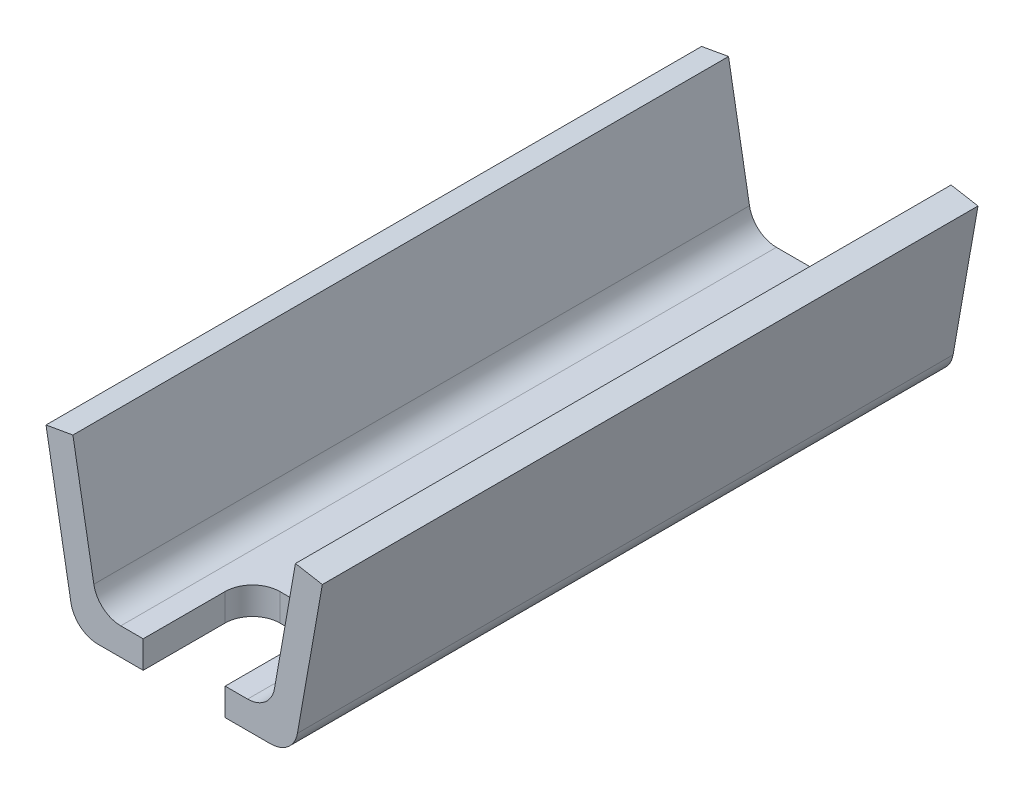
ISO-10303-21;
HEADER;
FILE_DESCRIPTION(('STEP AP214'),'2;1');
FILE_NAME('part.step','',(''),(''),'','','');
FILE_SCHEMA(('AUTOMOTIVE_DESIGN { 1 0 10303 214 1 1 1 1 }'));
ENDSEC;
DATA;
#1=APPLICATION_CONTEXT('core data for automotive mechanical design processes');
#2=APPLICATION_PROTOCOL_DEFINITION('international standard','automotive_design',2000,#1);
#3=PRODUCT_CONTEXT('',#1,'mechanical');
#4=PRODUCT('Part','Part','',(#3));
#5=PRODUCT_RELATED_PRODUCT_CATEGORY('part','',(#4));
#6=PRODUCT_DEFINITION_FORMATION('','',#4);
#7=PRODUCT_DEFINITION_CONTEXT('part definition',#1,'design');
#8=PRODUCT_DEFINITION('design','',#6,#7);
#9=PRODUCT_DEFINITION_SHAPE('','',#8);
#10=(LENGTH_UNIT() NAMED_UNIT(*) SI_UNIT(.MILLI.,.METRE.));
#11=(NAMED_UNIT(*) PLANE_ANGLE_UNIT() SI_UNIT($,.RADIAN.));
#12=(NAMED_UNIT(*) SI_UNIT($,.STERADIAN.) SOLID_ANGLE_UNIT());
#13=UNCERTAINTY_MEASURE_WITH_UNIT(LENGTH_MEASURE(1.E-05),#10,'distance_accuracy_value','');
#14=(GEOMETRIC_REPRESENTATION_CONTEXT(3) GLOBAL_UNCERTAINTY_ASSIGNED_CONTEXT((#13)) GLOBAL_UNIT_ASSIGNED_CONTEXT((#10,
#11,#12)) REPRESENTATION_CONTEXT('',''));
#15=CARTESIAN_POINT('',(0.,0.,0.));
#16=DIRECTION('',(0.,0.,1.));
#17=DIRECTION('',(1.,0.,0.));
#18=AXIS2_PLACEMENT_3D('',#15,#16,#17);
#19=CARTESIAN_POINT('',(11.6090036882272,10.,120.));
#20=DIRECTION('',(0.,0.,1.));
#21=DIRECTION('',(1.,0.,0.));
#22=AXIS2_PLACEMENT_3D('',#19,#20,#21);
#23=PLANE('',#22);
#24=DIRECTION('',(0.,-1.,0.));
#25=VECTOR('',#24,1.);
#26=CARTESIAN_POINT('',(-7.5,10.,120.));
#27=LINE('',#26,#25);
#28=CARTESIAN_POINT('',(-7.5,5.,120.));
#29=VERTEX_POINT('',#28);
#30=CARTESIAN_POINT('',(-7.5,0.,120.));
#31=VERTEX_POINT('',#30);
#32=EDGE_CURVE('E11',#29,#31,#27,.T.);
#33=ORIENTED_EDGE('',*,*,#32,.F.);
#34=DIRECTION('',(-1.,0.,0.));
#35=VECTOR('',#34,1.);
#36=CARTESIAN_POINT('',(11.6090036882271,5.,120.));
#37=LINE('',#36,#35);
#38=CARTESIAN_POINT('',(-11.6090036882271,5.,120.));
#39=VERTEX_POINT('',#38);
#40=EDGE_CURVE('E246',#29,#39,#37,.T.);
#41=ORIENTED_EDGE('',*,*,#40,.T.);
#42=CARTESIAN_POINT('',(-11.6090036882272,9.99999999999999,120.));
#43=DIRECTION('',(0.,0.,-1.));
#44=DIRECTION('',(-1.,0.,0.));
#45=AXIS2_PLACEMENT_3D('',#42,#43,#44);
#46=CIRCLE('',#45,5.);
#47=CARTESIAN_POINT('',(-16.5330424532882,9.13175911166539,120.));
#48=VERTEX_POINT('',#47);
#49=EDGE_CURVE('E250',#39,#48,#46,.T.);
#50=ORIENTED_EDGE('',*,*,#49,.T.);
#51=DIRECTION('',(-0.173648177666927,0.984807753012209,0.));
#52=VECTOR('',#51,1.);
#53=CARTESIAN_POINT('',(-16.5330424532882,9.13175911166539,120.));
#54=LINE('',#53,#52);
#55=CARTESIAN_POINT('',(-20.3657706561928,30.8682408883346,120.));
#56=VERTEX_POINT('',#55);
#57=EDGE_CURVE('E252',#48,#56,#54,.T.);
#58=ORIENTED_EDGE('',*,*,#57,.T.);
#59=DIRECTION('',(-0.984807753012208,-0.173648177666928,0.));
#60=VECTOR('',#59,1.);
#61=CARTESIAN_POINT('',(-25.2898094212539,30.,120.));
#62=LINE('',#61,#60);
#63=CARTESIAN_POINT('',(-25.2898094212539,30.,120.));
#64=VERTEX_POINT('',#63);
#65=EDGE_CURVE('E254',#56,#64,#62,.T.);
#66=ORIENTED_EDGE('',*,*,#65,.T.);
#67=DIRECTION('',(0.173648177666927,-0.984807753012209,0.));
#68=VECTOR('',#67,1.);
#69=CARTESIAN_POINT('',(-20.7285406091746,4.13175911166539,120.));
#70=LINE('',#69,#68);
#71=CARTESIAN_POINT('',(-20.7285406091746,4.13175911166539,120.));
#72=VERTEX_POINT('',#71);
#73=EDGE_CURVE('E256',#64,#72,#70,.T.);
#74=ORIENTED_EDGE('',*,*,#73,.T.);
#75=CARTESIAN_POINT('',(-15.8045018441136,5.,120.));
#76=DIRECTION('',(0.,0.,1.));
#77=DIRECTION('',(-1.,0.,0.));
#78=AXIS2_PLACEMENT_3D('',#75,#76,#77);
#79=CIRCLE('',#78,5.);
#80=CARTESIAN_POINT('',(-15.8045018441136,0.,120.));
#81=VERTEX_POINT('',#80);
#82=EDGE_CURVE('E258',#72,#81,#79,.T.);
#83=ORIENTED_EDGE('',*,*,#82,.T.);
#84=DIRECTION('',(1.,0.,0.));
#85=VECTOR('',#84,1.);
#86=CARTESIAN_POINT('',(-15.8045018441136,0.,120.));
#87=LINE('',#86,#85);
#88=EDGE_CURVE('E261',#81,#31,#87,.T.);
#89=ORIENTED_EDGE('',*,*,#88,.T.);
#90=EDGE_LOOP('',(#33,#41,#50,#58,#66,#74,#83,#89));
#91=FACE_BOUND('',#90,.T.);
#92=ADVANCED_FACE('F41',(#91),#23,.T.);
#93=CARTESIAN_POINT('',(25.2898094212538,30.,120.));
#94=DIRECTION('',(-0.173648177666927,-0.984807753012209,0.));
#95=DIRECTION('',(0.984807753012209,-0.173648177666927,0.));
#96=AXIS2_PLACEMENT_3D('',#93,#94,#95);
#97=PLANE('',#96);
#98=DIRECTION('',(-0.984807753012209,0.173648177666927,0.));
#99=VECTOR('',#98,1.);
#100=CARTESIAN_POINT('',(25.2898094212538,30.,0.));
#101=LINE('',#100,#99);
#102=CARTESIAN_POINT('',(25.2898094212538,30.,0.));
#103=VERTEX_POINT('',#102);
#104=CARTESIAN_POINT('',(20.3657706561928,30.8682408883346,0.));
#105=VERTEX_POINT('',#104);
#106=EDGE_CURVE('E215',#103,#105,#101,.T.);
#107=ORIENTED_EDGE('',*,*,#106,.T.);
#108=DIRECTION('',(0.,0.,-1.));
#109=VECTOR('',#108,1.);
#110=CARTESIAN_POINT('',(20.3657706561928,30.8682408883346,120.));
#111=LINE('',#110,#109);
#112=CARTESIAN_POINT('',(20.3657706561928,30.8682408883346,120.));
#113=VERTEX_POINT('',#112);
#114=EDGE_CURVE('E299',#113,#105,#111,.T.);
#115=ORIENTED_EDGE('',*,*,#114,.F.);
#116=DIRECTION('',(-0.984807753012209,0.173648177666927,0.));
#117=VECTOR('',#116,1.);
#118=CARTESIAN_POINT('',(25.2898094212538,30.,120.));
#119=LINE('',#118,#117);
#120=CARTESIAN_POINT('',(25.2898094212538,30.,120.));
#121=VERTEX_POINT('',#120);
#122=EDGE_CURVE('E240',#121,#113,#119,.T.);
#123=ORIENTED_EDGE('',*,*,#122,.F.);
#124=DIRECTION('',(0.,0.,-1.));
#125=VECTOR('',#124,1.);
#126=CARTESIAN_POINT('',(25.2898094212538,30.,120.));
#127=LINE('',#126,#125);
#128=EDGE_CURVE('E266',#121,#103,#127,.T.);
#129=ORIENTED_EDGE('',*,*,#128,.T.);
#130=EDGE_LOOP('',(#107,#115,#123,#129));
#131=FACE_BOUND('',#130,.T.);
#132=ADVANCED_FACE('F43',(#131),#97,.F.);
#133=CARTESIAN_POINT('',(20.3657706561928,30.8682408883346,120.));
#134=DIRECTION('',(0.984807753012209,-0.173648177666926,0.));
#135=DIRECTION('',(0.173648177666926,0.984807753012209,0.));
#136=AXIS2_PLACEMENT_3D('',#133,#134,#135);
#137=PLANE('',#136);
#138=DIRECTION('',(-0.173648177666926,-0.984807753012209,0.));
#139=VECTOR('',#138,1.);
#140=CARTESIAN_POINT('',(20.3657706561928,30.8682408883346,0.));
#141=LINE('',#140,#139);
#142=CARTESIAN_POINT('',(16.5330424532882,9.13175911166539,0.));
#143=VERTEX_POINT('',#142);
#144=EDGE_CURVE('E218',#105,#143,#141,.T.);
#145=ORIENTED_EDGE('',*,*,#144,.T.);
#146=DIRECTION('',(0.,0.,-1.));
#147=VECTOR('',#146,1.);
#148=CARTESIAN_POINT('',(16.5330424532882,9.13175911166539,120.));
#149=LINE('',#148,#147);
#150=CARTESIAN_POINT('',(16.5330424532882,9.13175911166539,120.));
#151=VERTEX_POINT('',#150);
#152=EDGE_CURVE('E296',#151,#143,#149,.T.);
#153=ORIENTED_EDGE('',*,*,#152,.F.);
#154=DIRECTION('',(-0.173648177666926,-0.984807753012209,0.));
#155=VECTOR('',#154,1.);
#156=CARTESIAN_POINT('',(20.3657706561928,30.8682408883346,120.));
#157=LINE('',#156,#155);
#158=EDGE_CURVE('E242',#113,#151,#157,.T.);
#159=ORIENTED_EDGE('',*,*,#158,.F.);
#160=ORIENTED_EDGE('',*,*,#114,.T.);
#161=EDGE_LOOP('',(#145,#153,#159,#160));
#162=FACE_BOUND('',#161,.T.);
#163=ADVANCED_FACE('F352',(#162),#137,.F.);
#164=CARTESIAN_POINT('',(11.6090036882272,10.,120.));
#165=DIRECTION('',(0.,0.,-1.));
#166=DIRECTION('',(-1.,0.,0.));
#167=AXIS2_PLACEMENT_3D('',#164,#165,#166);
#168=CYLINDRICAL_SURFACE('',#167,5.);
#169=CARTESIAN_POINT('',(11.6090036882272,10.,0.));
#170=DIRECTION('',(0.,0.,-1.));
#171=DIRECTION('',(1.,0.,0.));
#172=AXIS2_PLACEMENT_3D('',#169,#170,#171);
#173=CIRCLE('',#172,5.);
#174=CARTESIAN_POINT('',(11.6090036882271,5.,0.));
#175=VERTEX_POINT('',#174);
#176=EDGE_CURVE('E220',#143,#175,#173,.T.);
#177=ORIENTED_EDGE('',*,*,#176,.T.);
#178=DIRECTION('',(0.,0.,-1.));
#179=VECTOR('',#178,1.);
#180=CARTESIAN_POINT('',(11.6090036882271,5.,120.));
#181=LINE('',#180,#179);
#182=CARTESIAN_POINT('',(11.6090036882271,5.,120.));
#183=VERTEX_POINT('',#182);
#184=EDGE_CURVE('E293',#183,#175,#181,.T.);
#185=ORIENTED_EDGE('',*,*,#184,.F.);
#186=CARTESIAN_POINT('',(11.6090036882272,10.,120.));
#187=DIRECTION('',(0.,0.,-1.));
#188=DIRECTION('',(1.,0.,0.));
#189=AXIS2_PLACEMENT_3D('',#186,#187,#188);
#190=CIRCLE('',#189,5.);
#191=EDGE_CURVE('E244',#151,#183,#190,.T.);
#192=ORIENTED_EDGE('',*,*,#191,.F.);
#193=ORIENTED_EDGE('',*,*,#152,.T.);
#194=EDGE_LOOP('',(#177,#185,#192,#193));
#195=FACE_BOUND('',#194,.T.);
#196=ADVANCED_FACE('F313',(#195),#168,.F.);
#197=CARTESIAN_POINT('',(11.6090036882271,5.,120.));
#198=DIRECTION('',(0.,-1.,0.));
#199=DIRECTION('',(1.,0.,0.));
#200=AXIS2_PLACEMENT_3D('',#197,#198,#199);
#201=PLANE('',#200);
#202=ORIENTED_EDGE('',*,*,#40,.F.);
#203=DIRECTION('',(0.,0.,-1.));
#204=VECTOR('',#203,1.);
#205=CARTESIAN_POINT('',(-7.5,5.,120.));
#206=LINE('',#205,#204);
#207=CARTESIAN_POINT('',(-7.50000000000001,5.,105.));
#208=VERTEX_POINT('',#207);
#209=EDGE_CURVE('E206',#29,#208,#206,.T.);
#210=ORIENTED_EDGE('',*,*,#209,.T.);
#211=CARTESIAN_POINT('',(-2.5,5.,105.));
#212=DIRECTION('',(0.,-1.,0.));
#213=DIRECTION('',(1.,0.,0.));
#214=AXIS2_PLACEMENT_3D('',#211,#212,#213);
#215=CIRCLE('',#214,5.00000000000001);
#216=CARTESIAN_POINT('',(-2.5,5.,100.));
#217=VERTEX_POINT('',#216);
#218=EDGE_CURVE('E174',#208,#217,#215,.T.);
#219=ORIENTED_EDGE('',*,*,#218,.T.);
#220=DIRECTION('',(1.,0.,0.));
#221=VECTOR('',#220,1.);
#222=CARTESIAN_POINT('',(11.6090036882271,5.,100.));
#223=LINE('',#222,#221);
#224=CARTESIAN_POINT('',(2.5,5.,100.));
#225=VERTEX_POINT('',#224);
#226=EDGE_CURVE('E209',#217,#225,#223,.T.);
#227=ORIENTED_EDGE('',*,*,#226,.T.);
#228=CARTESIAN_POINT('',(2.5,5.,105.));
#229=DIRECTION('',(0.,-1.,0.));
#230=DIRECTION('',(1.,0.,0.));
#231=AXIS2_PLACEMENT_3D('',#228,#229,#230);
#232=CIRCLE('',#231,5.00000000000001);
#233=CARTESIAN_POINT('',(7.5,5.,105.));
#234=VERTEX_POINT('',#233);
#235=EDGE_CURVE('E212',#225,#234,#232,.T.);
#236=ORIENTED_EDGE('',*,*,#235,.T.);
#237=DIRECTION('',(0.,0.,1.));
#238=VECTOR('',#237,1.);
#239=CARTESIAN_POINT('',(7.5,5.,120.));
#240=LINE('',#239,#238);
#241=CARTESIAN_POINT('',(7.5,5.,120.));
#242=VERTEX_POINT('',#241);
#243=EDGE_CURVE('E200',#234,#242,#240,.T.);
#244=ORIENTED_EDGE('',*,*,#243,.T.);
#245=EDGE_CURVE('E247',#183,#242,#37,.T.);
#246=ORIENTED_EDGE('',*,*,#245,.F.);
#247=ORIENTED_EDGE('',*,*,#184,.T.);
#248=DIRECTION('',(-1.,0.,0.));
#249=VECTOR('',#248,1.);
#250=CARTESIAN_POINT('',(11.6090036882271,5.,0.));
#251=LINE('',#250,#249);
#252=CARTESIAN_POINT('',(-11.6090036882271,5.,0.));
#253=VERTEX_POINT('',#252);
#254=EDGE_CURVE('E222',#175,#253,#251,.T.);
#255=ORIENTED_EDGE('',*,*,#254,.T.);
#256=DIRECTION('',(0.,0.,-1.));
#257=VECTOR('',#256,1.);
#258=CARTESIAN_POINT('',(-11.6090036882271,5.,120.));
#259=LINE('',#258,#257);
#260=EDGE_CURVE('E290',#39,#253,#259,.T.);
#261=ORIENTED_EDGE('',*,*,#260,.F.);
#262=EDGE_LOOP('',(#202,#210,#219,#227,#236,#244,#246,#247,#255,#261));
#263=FACE_BOUND('',#262,.T.);
#264=ADVANCED_FACE('F307',(#263),#201,.F.);
#265=CARTESIAN_POINT('',(-11.6090036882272,9.99999999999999,120.));
#266=DIRECTION('',(0.,0.,-1.));
#267=DIRECTION('',(-1.,0.,0.));
#268=AXIS2_PLACEMENT_3D('',#265,#266,#267);
#269=CYLINDRICAL_SURFACE('',#268,5.);
#270=CARTESIAN_POINT('',(-11.6090036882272,9.99999999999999,0.));
#271=DIRECTION('',(0.,0.,-1.));
#272=DIRECTION('',(-1.,0.,0.));
#273=AXIS2_PLACEMENT_3D('',#270,#271,#272);
#274=CIRCLE('',#273,5.);
#275=CARTESIAN_POINT('',(-16.5330424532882,9.13175911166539,0.));
#276=VERTEX_POINT('',#275);
#277=EDGE_CURVE('E224',#253,#276,#274,.T.);
#278=ORIENTED_EDGE('',*,*,#277,.T.);
#279=DIRECTION('',(0.,0.,-1.));
#280=VECTOR('',#279,1.);
#281=CARTESIAN_POINT('',(-16.5330424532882,9.13175911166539,120.));
#282=LINE('',#281,#280);
#283=EDGE_CURVE('E287',#48,#276,#282,.T.);
#284=ORIENTED_EDGE('',*,*,#283,.F.);
#285=ORIENTED_EDGE('',*,*,#49,.F.);
#286=ORIENTED_EDGE('',*,*,#260,.T.);
#287=EDGE_LOOP('',(#278,#284,#285,#286));
#288=FACE_BOUND('',#287,.T.);
#289=ADVANCED_FACE('F325',(#288),#269,.F.);
#290=CARTESIAN_POINT('',(-16.5330424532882,9.13175911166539,120.));
#291=DIRECTION('',(-0.984807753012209,-0.173648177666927,0.));
#292=DIRECTION('',(0.173648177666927,-0.984807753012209,0.));
#293=AXIS2_PLACEMENT_3D('',#290,#291,#292);
#294=PLANE('',#293);
#295=DIRECTION('',(-0.173648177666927,0.984807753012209,0.));
#296=VECTOR('',#295,1.);
#297=CARTESIAN_POINT('',(-16.5330424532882,9.13175911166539,0.));
#298=LINE('',#297,#296);
#299=CARTESIAN_POINT('',(-20.3657706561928,30.8682408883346,0.));
#300=VERTEX_POINT('',#299);
#301=EDGE_CURVE('E226',#276,#300,#298,.T.);
#302=ORIENTED_EDGE('',*,*,#301,.T.);
#303=DIRECTION('',(0.,0.,-1.));
#304=VECTOR('',#303,1.);
#305=CARTESIAN_POINT('',(-20.3657706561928,30.8682408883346,120.));
#306=LINE('',#305,#304);
#307=EDGE_CURVE('E284',#56,#300,#306,.T.);
#308=ORIENTED_EDGE('',*,*,#307,.F.);
#309=ORIENTED_EDGE('',*,*,#57,.F.);
#310=ORIENTED_EDGE('',*,*,#283,.T.);
#311=EDGE_LOOP('',(#302,#308,#309,#310));
#312=FACE_BOUND('',#311,.T.);
#313=ADVANCED_FACE('F329',(#312),#294,.F.);
#314=CARTESIAN_POINT('',(-25.2898094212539,30.,120.));
#315=DIRECTION('',(0.173648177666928,-0.984807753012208,0.));
#316=DIRECTION('',(0.984807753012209,0.173648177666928,0.));
#317=AXIS2_PLACEMENT_3D('',#314,#315,#316);
#318=PLANE('',#317);
#319=DIRECTION('',(-0.984807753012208,-0.173648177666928,0.));
#320=VECTOR('',#319,1.);
#321=CARTESIAN_POINT('',(-25.2898094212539,30.,0.));
#322=LINE('',#321,#320);
#323=CARTESIAN_POINT('',(-25.2898094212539,30.,0.));
#324=VERTEX_POINT('',#323);
#325=EDGE_CURVE('E228',#300,#324,#322,.T.);
#326=ORIENTED_EDGE('',*,*,#325,.T.);
#327=DIRECTION('',(0.,0.,-1.));
#328=VECTOR('',#327,1.);
#329=CARTESIAN_POINT('',(-25.2898094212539,30.,120.));
#330=LINE('',#329,#328);
#331=EDGE_CURVE('E281',#64,#324,#330,.T.);
#332=ORIENTED_EDGE('',*,*,#331,.F.);
#333=ORIENTED_EDGE('',*,*,#65,.F.);
#334=ORIENTED_EDGE('',*,*,#307,.T.);
#335=EDGE_LOOP('',(#326,#332,#333,#334));
#336=FACE_BOUND('',#335,.T.);
#337=ADVANCED_FACE('F365',(#336),#318,.F.);
#338=CARTESIAN_POINT('',(-20.7285406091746,4.13175911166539,120.));
#339=DIRECTION('',(0.984807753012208,0.173648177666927,0.));
#340=DIRECTION('',(-0.173648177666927,0.984807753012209,0.));
#341=AXIS2_PLACEMENT_3D('',#338,#339,#340);
#342=PLANE('',#341);
#343=DIRECTION('',(0.173648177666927,-0.984807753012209,0.));
#344=VECTOR('',#343,1.);
#345=CARTESIAN_POINT('',(-20.7285406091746,4.13175911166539,0.));
#346=LINE('',#345,#344);
#347=CARTESIAN_POINT('',(-20.7285406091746,4.13175911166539,0.));
#348=VERTEX_POINT('',#347);
#349=EDGE_CURVE('E230',#324,#348,#346,.T.);
#350=ORIENTED_EDGE('',*,*,#349,.T.);
#351=DIRECTION('',(0.,0.,-1.));
#352=VECTOR('',#351,1.);
#353=CARTESIAN_POINT('',(-20.7285406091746,4.13175911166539,120.));
#354=LINE('',#353,#352);
#355=EDGE_CURVE('E278',#72,#348,#354,.T.);
#356=ORIENTED_EDGE('',*,*,#355,.F.);
#357=ORIENTED_EDGE('',*,*,#73,.F.);
#358=ORIENTED_EDGE('',*,*,#331,.T.);
#359=EDGE_LOOP('',(#350,#356,#357,#358));
#360=FACE_BOUND('',#359,.T.);
#361=ADVANCED_FACE('F363',(#360),#342,.F.);
#362=CARTESIAN_POINT('',(-15.8045018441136,5.,120.));
#363=DIRECTION('',(0.,0.,-1.));
#364=DIRECTION('',(-1.,0.,0.));
#365=AXIS2_PLACEMENT_3D('',#362,#363,#364);
#366=CYLINDRICAL_SURFACE('',#365,5.);
#367=CARTESIAN_POINT('',(-15.8045018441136,5.,0.));
#368=DIRECTION('',(0.,0.,1.));
#369=DIRECTION('',(-1.,0.,0.));
#370=AXIS2_PLACEMENT_3D('',#367,#368,#369);
#371=CIRCLE('',#370,5.);
#372=CARTESIAN_POINT('',(-15.8045018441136,0.,0.));
#373=VERTEX_POINT('',#372);
#374=EDGE_CURVE('E232',#348,#373,#371,.T.);
#375=ORIENTED_EDGE('',*,*,#374,.T.);
#376=DIRECTION('',(0.,0.,-1.));
#377=VECTOR('',#376,1.);
#378=CARTESIAN_POINT('',(-15.8045018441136,0.,120.));
#379=LINE('',#378,#377);
#380=EDGE_CURVE('E275',#81,#373,#379,.T.);
#381=ORIENTED_EDGE('',*,*,#380,.F.);
#382=ORIENTED_EDGE('',*,*,#82,.F.);
#383=ORIENTED_EDGE('',*,*,#355,.T.);
#384=EDGE_LOOP('',(#375,#381,#382,#383));
#385=FACE_BOUND('',#384,.T.);
#386=ADVANCED_FACE('F359',(#385),#366,.T.);
#387=CARTESIAN_POINT('',(-15.8045018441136,0.,120.));
#388=DIRECTION('',(0.,1.,0.));
#389=DIRECTION('',(0.,0.,1.));
#390=AXIS2_PLACEMENT_3D('',#387,#388,#389);
#391=PLANE('',#390);
#392=CARTESIAN_POINT('',(-2.5,0.,105.));
#393=DIRECTION('',(0.,-1.,0.));
#394=DIRECTION('',(0.,0.,1.));
#395=AXIS2_PLACEMENT_3D('',#392,#393,#394);
#396=CIRCLE('',#395,5.00000000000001);
#397=CARTESIAN_POINT('',(-7.50000000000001,0.,105.));
#398=VERTEX_POINT('',#397);
#399=CARTESIAN_POINT('',(-2.5,0.,100.));
#400=VERTEX_POINT('',#399);
#401=EDGE_CURVE('E171',#398,#400,#396,.T.);
#402=ORIENTED_EDGE('',*,*,#401,.F.);
#403=DIRECTION('',(0.,0.,-1.));
#404=VECTOR('',#403,1.);
#405=CARTESIAN_POINT('',(-7.5,0.,105.));
#406=LINE('',#405,#404);
#407=EDGE_CURVE('E180',#31,#398,#406,.T.);
#408=ORIENTED_EDGE('',*,*,#407,.F.);
#409=ORIENTED_EDGE('',*,*,#88,.F.);
#410=ORIENTED_EDGE('',*,*,#380,.T.);
#411=DIRECTION('',(1.,0.,0.));
#412=VECTOR('',#411,1.);
#413=CARTESIAN_POINT('',(-15.8045018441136,0.,0.));
#414=LINE('',#413,#412);
#415=CARTESIAN_POINT('',(15.8045018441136,0.,0.));
#416=VERTEX_POINT('',#415);
#417=EDGE_CURVE('E234',#373,#416,#414,.T.);
#418=ORIENTED_EDGE('',*,*,#417,.T.);
#419=DIRECTION('',(0.,0.,-1.));
#420=VECTOR('',#419,1.);
#421=CARTESIAN_POINT('',(15.8045018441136,0.,120.));
#422=LINE('',#421,#420);
#423=CARTESIAN_POINT('',(15.8045018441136,0.,120.));
#424=VERTEX_POINT('',#423);
#425=EDGE_CURVE('E272',#424,#416,#422,.T.);
#426=ORIENTED_EDGE('',*,*,#425,.F.);
#427=CARTESIAN_POINT('',(7.50000000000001,0.,120.));
#428=VERTEX_POINT('',#427);
#429=EDGE_CURVE('E260',#428,#424,#87,.T.);
#430=ORIENTED_EDGE('',*,*,#429,.F.);
#431=DIRECTION('',(0.,0.,1.));
#432=VECTOR('',#431,1.);
#433=CARTESIAN_POINT('',(7.5,0.,120.));
#434=LINE('',#433,#432);
#435=CARTESIAN_POINT('',(7.5,0.,105.));
#436=VERTEX_POINT('',#435);
#437=EDGE_CURVE('E56',#436,#428,#434,.T.);
#438=ORIENTED_EDGE('',*,*,#437,.F.);
#439=CARTESIAN_POINT('',(2.5,0.,105.));
#440=DIRECTION('',(0.,-1.,0.));
#441=DIRECTION('',(0.,0.,1.));
#442=AXIS2_PLACEMENT_3D('',#439,#440,#441);
#443=CIRCLE('',#442,5.00000000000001);
#444=CARTESIAN_POINT('',(2.5,0.,100.));
#445=VERTEX_POINT('',#444);
#446=EDGE_CURVE('E192',#445,#436,#443,.T.);
#447=ORIENTED_EDGE('',*,*,#446,.F.);
#448=DIRECTION('',(1.,0.,0.));
#449=VECTOR('',#448,1.);
#450=CARTESIAN_POINT('',(2.5,0.,100.));
#451=LINE('',#450,#449);
#452=EDGE_CURVE('E190',#400,#445,#451,.T.);
#453=ORIENTED_EDGE('',*,*,#452,.F.);
#454=EDGE_LOOP('',(#402,#408,#409,#410,#418,#426,#430,#438,#447,#453));
#455=FACE_BOUND('',#454,.T.);
#456=ADVANCED_FACE('F187',(#455),#391,.F.);
#457=CARTESIAN_POINT('',(15.8045018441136,5.,120.));
#458=DIRECTION('',(0.,0.,-1.));
#459=DIRECTION('',(-1.,0.,0.));
#460=AXIS2_PLACEMENT_3D('',#457,#458,#459);
#461=CYLINDRICAL_SURFACE('',#460,5.);
#462=CARTESIAN_POINT('',(15.8045018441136,5.,0.));
#463=DIRECTION('',(0.,0.,1.));
#464=DIRECTION('',(1.,0.,0.));
#465=AXIS2_PLACEMENT_3D('',#462,#463,#464);
#466=CIRCLE('',#465,5.);
#467=CARTESIAN_POINT('',(20.7285406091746,4.1317591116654,0.));
#468=VERTEX_POINT('',#467);
#469=EDGE_CURVE('E236',#416,#468,#466,.T.);
#470=ORIENTED_EDGE('',*,*,#469,.T.);
#471=DIRECTION('',(0.,0.,-1.));
#472=VECTOR('',#471,1.);
#473=CARTESIAN_POINT('',(20.7285406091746,4.1317591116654,120.));
#474=LINE('',#473,#472);
#475=CARTESIAN_POINT('',(20.7285406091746,4.1317591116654,120.));
#476=VERTEX_POINT('',#475);
#477=EDGE_CURVE('E269',#476,#468,#474,.T.);
#478=ORIENTED_EDGE('',*,*,#477,.F.);
#479=CARTESIAN_POINT('',(15.8045018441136,5.,120.));
#480=DIRECTION('',(0.,0.,1.));
#481=DIRECTION('',(1.,0.,0.));
#482=AXIS2_PLACEMENT_3D('',#479,#480,#481);
#483=CIRCLE('',#482,5.);
#484=EDGE_CURVE('E263',#424,#476,#483,.T.);
#485=ORIENTED_EDGE('',*,*,#484,.F.);
#486=ORIENTED_EDGE('',*,*,#425,.T.);
#487=EDGE_LOOP('',(#470,#478,#485,#486));
#488=FACE_BOUND('',#487,.T.);
#489=ADVANCED_FACE('F343',(#488),#461,.T.);
#490=CARTESIAN_POINT('',(20.7285406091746,4.1317591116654,120.));
#491=DIRECTION('',(-0.984807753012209,0.173648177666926,0.));
#492=DIRECTION('',(-0.173648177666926,-0.984807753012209,0.));
#493=AXIS2_PLACEMENT_3D('',#490,#491,#492);
#494=PLANE('',#493);
#495=DIRECTION('',(0.173648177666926,0.984807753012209,0.));
#496=VECTOR('',#495,1.);
#497=CARTESIAN_POINT('',(20.7285406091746,4.1317591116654,0.));
#498=LINE('',#497,#496);
#499=EDGE_CURVE('E238',#468,#103,#498,.T.);
#500=ORIENTED_EDGE('',*,*,#499,.T.);
#501=ORIENTED_EDGE('',*,*,#128,.F.);
#502=DIRECTION('',(0.173648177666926,0.984807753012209,0.));
#503=VECTOR('',#502,1.);
#504=CARTESIAN_POINT('',(20.7285406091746,4.1317591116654,120.));
#505=LINE('',#504,#503);
#506=EDGE_CURVE('E64',#476,#121,#505,.T.);
#507=ORIENTED_EDGE('',*,*,#506,.F.);
#508=ORIENTED_EDGE('',*,*,#477,.T.);
#509=EDGE_LOOP('',(#500,#501,#507,#508));
#510=FACE_BOUND('',#509,.T.);
#511=ADVANCED_FACE('F347',(#510),#494,.F.);
#512=DIRECTION('',(0.,1.,0.));
#513=VECTOR('',#512,1.);
#514=CARTESIAN_POINT('',(7.5,10.,120.));
#515=LINE('',#514,#513);
#516=EDGE_CURVE('E49',#428,#242,#515,.T.);
#517=ORIENTED_EDGE('',*,*,#516,.F.);
#518=ORIENTED_EDGE('',*,*,#429,.T.);
#519=ORIENTED_EDGE('',*,*,#484,.T.);
#520=ORIENTED_EDGE('',*,*,#506,.T.);
#521=ORIENTED_EDGE('',*,*,#122,.T.);
#522=ORIENTED_EDGE('',*,*,#158,.T.);
#523=ORIENTED_EDGE('',*,*,#191,.T.);
#524=ORIENTED_EDGE('',*,*,#245,.T.);
#525=EDGE_LOOP('',(#517,#518,#519,#520,#521,#522,#523,#524));
#526=FACE_BOUND('',#525,.T.);
#527=ADVANCED_FACE('F308',(#526),#23,.T.);
#528=CARTESIAN_POINT('',(11.6090036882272,10.,0.));
#529=DIRECTION('',(0.,0.,1.));
#530=DIRECTION('',(1.,0.,0.));
#531=AXIS2_PLACEMENT_3D('',#528,#529,#530);
#532=PLANE('',#531);
#533=ORIENTED_EDGE('',*,*,#106,.F.);
#534=ORIENTED_EDGE('',*,*,#499,.F.);
#535=ORIENTED_EDGE('',*,*,#469,.F.);
#536=ORIENTED_EDGE('',*,*,#417,.F.);
#537=ORIENTED_EDGE('',*,*,#374,.F.);
#538=ORIENTED_EDGE('',*,*,#349,.F.);
#539=ORIENTED_EDGE('',*,*,#325,.F.);
#540=ORIENTED_EDGE('',*,*,#301,.F.);
#541=ORIENTED_EDGE('',*,*,#277,.F.);
#542=ORIENTED_EDGE('',*,*,#254,.F.);
#543=ORIENTED_EDGE('',*,*,#176,.F.);
#544=ORIENTED_EDGE('',*,*,#144,.F.);
#545=EDGE_LOOP('',(#533,#534,#535,#536,#537,#538,#539,#540,#541,#542,#543,#544));
#546=FACE_BOUND('',#545,.T.);
#547=ADVANCED_FACE('F320',(#546),#532,.F.);
#548=CARTESIAN_POINT('',(2.5,30.8682408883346,105.));
#549=DIRECTION('',(0.,-1.,0.));
#550=DIRECTION('',(0.,0.,-1.));
#551=AXIS2_PLACEMENT_3D('',#548,#549,#550);
#552=CYLINDRICAL_SURFACE('',#551,5.00000000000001);
#553=DIRECTION('',(0.,-1.,0.));
#554=VECTOR('',#553,1.);
#555=CARTESIAN_POINT('',(2.5,30.8682408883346,100.));
#556=LINE('',#555,#554);
#557=EDGE_CURVE('E201',#225,#445,#556,.T.);
#558=ORIENTED_EDGE('',*,*,#557,.T.);
#559=ORIENTED_EDGE('',*,*,#446,.T.);
#560=DIRECTION('',(0.,-1.,0.));
#561=VECTOR('',#560,1.);
#562=CARTESIAN_POINT('',(7.5,30.8682408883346,105.));
#563=LINE('',#562,#561);
#564=EDGE_CURVE('E198',#234,#436,#563,.T.);
#565=ORIENTED_EDGE('',*,*,#564,.F.);
#566=ORIENTED_EDGE('',*,*,#235,.F.);
#567=EDGE_LOOP('',(#558,#559,#565,#566));
#568=FACE_BOUND('',#567,.T.);
#569=ADVANCED_FACE('F338',(#568),#552,.F.);
#570=CARTESIAN_POINT('',(2.5,30.8682408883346,100.));
#571=DIRECTION('',(0.,0.,-1.));
#572=DIRECTION('',(-1.,0.,0.));
#573=AXIS2_PLACEMENT_3D('',#570,#571,#572);
#574=PLANE('',#573);
#575=DIRECTION('',(0.,-1.,0.));
#576=VECTOR('',#575,1.);
#577=CARTESIAN_POINT('',(-2.5,30.8682408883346,100.));
#578=LINE('',#577,#576);
#579=EDGE_CURVE('E177',#217,#400,#578,.T.);
#580=ORIENTED_EDGE('',*,*,#579,.T.);
#581=ORIENTED_EDGE('',*,*,#452,.T.);
#582=ORIENTED_EDGE('',*,*,#557,.F.);
#583=ORIENTED_EDGE('',*,*,#226,.F.);
#584=EDGE_LOOP('',(#580,#581,#582,#583));
#585=FACE_BOUND('',#584,.T.);
#586=ADVANCED_FACE('F336',(#585),#574,.F.);
#587=CARTESIAN_POINT('',(-2.5,30.8682408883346,105.));
#588=DIRECTION('',(0.,-1.,0.));
#589=DIRECTION('',(0.,0.,-1.));
#590=AXIS2_PLACEMENT_3D('',#587,#588,#589);
#591=CYLINDRICAL_SURFACE('',#590,5.00000000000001);
#592=DIRECTION('',(0.,-1.,0.));
#593=VECTOR('',#592,1.);
#594=CARTESIAN_POINT('',(-7.50000000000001,30.8682408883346,105.));
#595=LINE('',#594,#593);
#596=EDGE_CURVE('E166',#208,#398,#595,.T.);
#597=ORIENTED_EDGE('',*,*,#596,.T.);
#598=ORIENTED_EDGE('',*,*,#401,.T.);
#599=ORIENTED_EDGE('',*,*,#579,.F.);
#600=ORIENTED_EDGE('',*,*,#218,.F.);
#601=EDGE_LOOP('',(#597,#598,#599,#600));
#602=FACE_BOUND('',#601,.T.);
#603=ADVANCED_FACE('F168',(#602),#591,.F.);
#604=CARTESIAN_POINT('',(-7.5,30.8682408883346,105.));
#605=DIRECTION('',(-1.,0.,0.));
#606=DIRECTION('',(0.,0.,1.));
#607=AXIS2_PLACEMENT_3D('',#604,#605,#606);
#608=PLANE('',#607);
#609=ORIENTED_EDGE('',*,*,#32,.T.);
#610=ORIENTED_EDGE('',*,*,#407,.T.);
#611=ORIENTED_EDGE('',*,*,#596,.F.);
#612=ORIENTED_EDGE('',*,*,#209,.F.);
#613=EDGE_LOOP('',(#609,#610,#611,#612));
#614=FACE_BOUND('',#613,.T.);
#615=ADVANCED_FACE('F181',(#614),#608,.F.);
#616=CARTESIAN_POINT('',(7.5,30.8682408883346,120.));
#617=DIRECTION('',(1.,0.,0.));
#618=DIRECTION('',(0.,0.,-1.));
#619=AXIS2_PLACEMENT_3D('',#616,#617,#618);
#620=PLANE('',#619);
#621=ORIENTED_EDGE('',*,*,#564,.T.);
#622=ORIENTED_EDGE('',*,*,#437,.T.);
#623=ORIENTED_EDGE('',*,*,#516,.T.);
#624=ORIENTED_EDGE('',*,*,#243,.F.);
#625=EDGE_LOOP('',(#621,#622,#623,#624));
#626=FACE_BOUND('',#625,.T.);
#627=ADVANCED_FACE('F301',(#626),#620,.F.);
#628=CLOSED_SHELL('',(#92,#132,#163,#196,#264,#289,#313,#337,#361,#386,#456,#489,#511,#527,#547,
#569,#586,#603,#615,#627));
#629=MANIFOLD_SOLID_BREP('B2',#628);
#630=ADVANCED_BREP_SHAPE_REPRESENTATION('',(#18,#629),#14);
#631=SHAPE_DEFINITION_REPRESENTATION(#9,#630);
ENDSEC;
END-ISO-10303-21;
